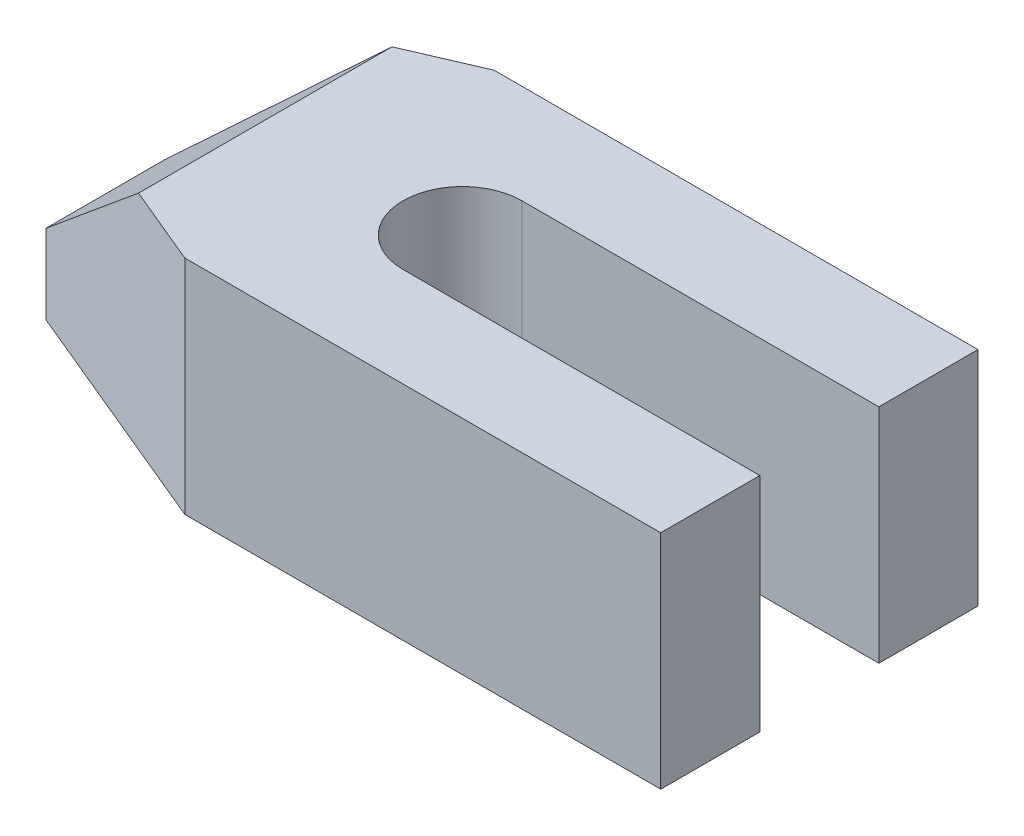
ISO-10303-21;
HEADER;
FILE_DESCRIPTION(('STEP AP214'),'2;1');
FILE_NAME('part.step','',(''),(''),'','','');
FILE_SCHEMA(('AUTOMOTIVE_DESIGN { 1 0 10303 214 1 1 1 1 }'));
ENDSEC;
DATA;
#1=APPLICATION_CONTEXT('core data for automotive mechanical design processes');
#2=APPLICATION_PROTOCOL_DEFINITION('international standard','automotive_design',2000,#1);
#3=PRODUCT_CONTEXT('',#1,'mechanical');
#4=PRODUCT('Part','Part','',(#3));
#5=PRODUCT_RELATED_PRODUCT_CATEGORY('part','',(#4));
#6=PRODUCT_DEFINITION_FORMATION('','',#4);
#7=PRODUCT_DEFINITION_CONTEXT('part definition',#1,'design');
#8=PRODUCT_DEFINITION('design','',#6,#7);
#9=PRODUCT_DEFINITION_SHAPE('','',#8);
#10=(LENGTH_UNIT() NAMED_UNIT(*) SI_UNIT(.MILLI.,.METRE.));
#11=(NAMED_UNIT(*) PLANE_ANGLE_UNIT() SI_UNIT($,.RADIAN.));
#12=(NAMED_UNIT(*) SI_UNIT($,.STERADIAN.) SOLID_ANGLE_UNIT());
#13=UNCERTAINTY_MEASURE_WITH_UNIT(LENGTH_MEASURE(1.E-05),#10,'distance_accuracy_value','');
#14=(GEOMETRIC_REPRESENTATION_CONTEXT(3) GLOBAL_UNCERTAINTY_ASSIGNED_CONTEXT((#13)) GLOBAL_UNIT_ASSIGNED_CONTEXT((#10,
#11,#12)) REPRESENTATION_CONTEXT('',''));
#15=CARTESIAN_POINT('',(0.,0.,0.));
#16=DIRECTION('',(0.,0.,1.));
#17=DIRECTION('',(1.,0.,0.));
#18=AXIS2_PLACEMENT_3D('',#15,#16,#17);
#19=CARTESIAN_POINT('',(-16.,28.,-20.));
#20=DIRECTION('',(0.395829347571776,0.,0.918324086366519));
#21=DIRECTION('',(0.918324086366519,0.,-0.395829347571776));
#22=AXIS2_PLACEMENT_3D('',#19,#20,#21);
#23=PLANE('',#22);
#24=DIRECTION('',(-0.707852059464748,-0.637066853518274,0.305108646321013));
#25=VECTOR('',#24,1.);
#26=CARTESIAN_POINT('',(-19.6526875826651,32.8125811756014,-18.4255656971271));
#27=LINE('',#26,#25);
#28=CARTESIAN_POINT('',(-25.,28.,-16.1206896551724));
#29=VERTEX_POINT('',#28);
#30=CARTESIAN_POINT('',(-45.,10.,-7.49999999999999));
#31=VERTEX_POINT('',#30);
#32=EDGE_CURVE('E149',#29,#31,#27,.T.);
#33=ORIENTED_EDGE('',*,*,#32,.F.);
#34=DIRECTION('',(-0.918324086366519,0.,0.395829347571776));
#35=VECTOR('',#34,1.);
#36=CARTESIAN_POINT('',(-16.,28.,-20.));
#37=LINE('',#36,#35);
#38=CARTESIAN_POINT('',(-16.,28.,-20.));
#39=VERTEX_POINT('',#38);
#40=EDGE_CURVE('E166',#39,#29,#37,.T.);
#41=ORIENTED_EDGE('',*,*,#40,.F.);
#42=DIRECTION('',(0.,-1.,0.));
#43=VECTOR('',#42,1.);
#44=CARTESIAN_POINT('',(-16.,28.,-20.));
#45=LINE('',#44,#43);
#46=CARTESIAN_POINT('',(-16.,0.,-20.));
#47=VERTEX_POINT('',#46);
#48=EDGE_CURVE('E141',#39,#47,#45,.T.);
#49=ORIENTED_EDGE('',*,*,#48,.T.);
#50=DIRECTION('',(-0.918324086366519,0.,0.395829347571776));
#51=VECTOR('',#50,1.);
#52=CARTESIAN_POINT('',(-16.,0.,-20.));
#53=LINE('',#52,#51);
#54=CARTESIAN_POINT('',(-45.,0.,-7.49999999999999));
#55=VERTEX_POINT('',#54);
#56=EDGE_CURVE('E145',#47,#55,#53,.T.);
#57=ORIENTED_EDGE('',*,*,#56,.T.);
#58=DIRECTION('',(0.,-1.,0.));
#59=VECTOR('',#58,1.);
#60=CARTESIAN_POINT('',(-45.,28.,-7.49999999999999));
#61=LINE('',#60,#59);
#62=EDGE_CURVE('E40',#31,#55,#61,.T.);
#63=ORIENTED_EDGE('',*,*,#62,.F.);
#64=EDGE_LOOP('',(#33,#41,#49,#57,#63));
#65=FACE_BOUND('',#64,.T.);
#66=ADVANCED_FACE('F33',(#65),#23,.F.);
#67=CARTESIAN_POINT('',(-45.,28.,-7.49999999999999));
#68=DIRECTION('',(1.,0.,0.));
#69=DIRECTION('',(0.,0.,-1.));
#70=AXIS2_PLACEMENT_3D('',#67,#68,#69);
#71=PLANE('',#70);
#72=DIRECTION('',(0.,0.,1.));
#73=VECTOR('',#72,1.);
#74=CARTESIAN_POINT('',(-45.,10.,-20.));
#75=LINE('',#74,#73);
#76=CARTESIAN_POINT('',(-45.,10.,7.50000000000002));
#77=VERTEX_POINT('',#76);
#78=EDGE_CURVE('E191',#31,#77,#75,.T.);
#79=ORIENTED_EDGE('',*,*,#78,.F.);
#80=ORIENTED_EDGE('',*,*,#62,.T.);
#81=DIRECTION('',(0.,0.,1.));
#82=VECTOR('',#81,1.);
#83=CARTESIAN_POINT('',(-45.,0.,-7.49999999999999));
#84=LINE('',#83,#82);
#85=CARTESIAN_POINT('',(-45.,0.,7.50000000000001));
#86=VERTEX_POINT('',#85);
#87=EDGE_CURVE('E148',#55,#86,#84,.T.);
#88=ORIENTED_EDGE('',*,*,#87,.T.);
#89=DIRECTION('',(0.,-1.,0.));
#90=VECTOR('',#89,1.);
#91=CARTESIAN_POINT('',(-45.,28.,7.50000000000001));
#92=LINE('',#91,#90);
#93=EDGE_CURVE('E182',#77,#86,#92,.T.);
#94=ORIENTED_EDGE('',*,*,#93,.F.);
#95=EDGE_LOOP('',(#79,#80,#88,#94));
#96=FACE_BOUND('',#95,.T.);
#97=ADVANCED_FACE('F187',(#96),#71,.F.);
#98=CARTESIAN_POINT('',(-15.,28.,20.));
#99=DIRECTION('',(0.384615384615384,0.,-0.923076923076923));
#100=DIRECTION('',(-0.923076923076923,0.,-0.384615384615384));
#101=AXIS2_PLACEMENT_3D('',#98,#99,#100);
#102=PLANE('',#101);
#103=DIRECTION('',(0.710021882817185,0.639019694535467,0.295842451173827));
#104=VECTOR('',#103,1.);
#105=CARTESIAN_POINT('',(-19.083461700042,33.3248844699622,18.2985576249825));
#106=LINE('',#105,#104);
#107=CARTESIAN_POINT('',(-25.,28.,15.8333333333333));
#108=VERTEX_POINT('',#107);
#109=EDGE_CURVE('E47',#77,#108,#106,.T.);
#110=ORIENTED_EDGE('',*,*,#109,.F.);
#111=ORIENTED_EDGE('',*,*,#93,.T.);
#112=DIRECTION('',(0.923076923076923,0.,0.384615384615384));
#113=VECTOR('',#112,1.);
#114=CARTESIAN_POINT('',(-15.,0.,20.));
#115=LINE('',#114,#113);
#116=CARTESIAN_POINT('',(-15.,0.,20.));
#117=VERTEX_POINT('',#116);
#118=EDGE_CURVE('E152',#86,#117,#115,.T.);
#119=ORIENTED_EDGE('',*,*,#118,.T.);
#120=DIRECTION('',(0.,-1.,0.));
#121=VECTOR('',#120,1.);
#122=CARTESIAN_POINT('',(-15.,28.,20.));
#123=LINE('',#122,#121);
#124=CARTESIAN_POINT('',(-15.,28.,20.));
#125=VERTEX_POINT('',#124);
#126=EDGE_CURVE('E179',#125,#117,#123,.T.);
#127=ORIENTED_EDGE('',*,*,#126,.F.);
#128=DIRECTION('',(0.923076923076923,0.,0.384615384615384));
#129=VECTOR('',#128,1.);
#130=CARTESIAN_POINT('',(-15.,28.,20.));
#131=LINE('',#130,#129);
#132=EDGE_CURVE('E101',#108,#125,#131,.T.);
#133=ORIENTED_EDGE('',*,*,#132,.F.);
#134=EDGE_LOOP('',(#110,#111,#119,#127,#133));
#135=FACE_BOUND('',#134,.T.);
#136=ADVANCED_FACE('F221',(#135),#102,.F.);
#137=CARTESIAN_POINT('',(0.,28.,0.));
#138=DIRECTION('',(0.,1.,0.));
#139=DIRECTION('',(0.,0.,1.));
#140=AXIS2_PLACEMENT_3D('',#137,#138,#139);
#141=PLANE('',#140);
#142=ORIENTED_EDGE('',*,*,#40,.T.);
#143=DIRECTION('',(0.,0.,1.));
#144=VECTOR('',#143,1.);
#145=CARTESIAN_POINT('',(-25.,28.,0.));
#146=LINE('',#145,#144);
#147=EDGE_CURVE('E11',#29,#108,#146,.T.);
#148=ORIENTED_EDGE('',*,*,#147,.T.);
#149=ORIENTED_EDGE('',*,*,#132,.T.);
#150=DIRECTION('',(1.,0.,0.));
#151=VECTOR('',#150,1.);
#152=CARTESIAN_POINT('',(-15.,28.,20.));
#153=LINE('',#152,#151);
#154=CARTESIAN_POINT('',(45.,28.,20.));
#155=VERTEX_POINT('',#154);
#156=EDGE_CURVE('E219',#125,#155,#153,.T.);
#157=ORIENTED_EDGE('',*,*,#156,.T.);
#158=DIRECTION('',(0.,0.,-1.));
#159=VECTOR('',#158,1.);
#160=CARTESIAN_POINT('',(45.,28.,7.5));
#161=LINE('',#160,#159);
#162=CARTESIAN_POINT('',(45.,28.,7.5));
#163=VERTEX_POINT('',#162);
#164=EDGE_CURVE('E214',#155,#163,#161,.T.);
#165=ORIENTED_EDGE('',*,*,#164,.T.);
#166=DIRECTION('',(-1.,0.,0.));
#167=VECTOR('',#166,1.);
#168=CARTESIAN_POINT('',(0.,28.,7.5));
#169=LINE('',#168,#167);
#170=CARTESIAN_POINT('',(0.,28.,7.5));
#171=VERTEX_POINT('',#170);
#172=EDGE_CURVE('E209',#163,#171,#169,.T.);
#173=ORIENTED_EDGE('',*,*,#172,.T.);
#174=CARTESIAN_POINT('',(0.,28.,0.));
#175=DIRECTION('',(0.,-1.,0.));
#176=DIRECTION('',(0.,0.,1.));
#177=AXIS2_PLACEMENT_3D('',#174,#175,#176);
#178=CIRCLE('',#177,7.5);
#179=CARTESIAN_POINT('',(0.,28.,-7.5));
#180=VERTEX_POINT('',#179);
#181=EDGE_CURVE('E124',#171,#180,#178,.T.);
#182=ORIENTED_EDGE('',*,*,#181,.T.);
#183=DIRECTION('',(1.,0.,0.));
#184=VECTOR('',#183,1.);
#185=CARTESIAN_POINT('',(0.,28.,-7.5));
#186=LINE('',#185,#184);
#187=CARTESIAN_POINT('',(45.,28.,-7.5));
#188=VERTEX_POINT('',#187);
#189=EDGE_CURVE('E117',#180,#188,#186,.T.);
#190=ORIENTED_EDGE('',*,*,#189,.T.);
#191=DIRECTION('',(0.,0.,-1.));
#192=VECTOR('',#191,1.);
#193=CARTESIAN_POINT('',(45.,28.,-20.));
#194=LINE('',#193,#192);
#195=CARTESIAN_POINT('',(45.,28.,-20.));
#196=VERTEX_POINT('',#195);
#197=EDGE_CURVE('E121',#188,#196,#194,.T.);
#198=ORIENTED_EDGE('',*,*,#197,.T.);
#199=DIRECTION('',(-1.,0.,0.));
#200=VECTOR('',#199,1.);
#201=CARTESIAN_POINT('',(-16.,28.,-20.));
#202=LINE('',#201,#200);
#203=EDGE_CURVE('E55',#196,#39,#202,.T.);
#204=ORIENTED_EDGE('',*,*,#203,.T.);
#205=EDGE_LOOP('',(#142,#148,#149,#157,#165,#173,#182,#190,#198,#204));
#206=FACE_BOUND('',#205,.T.);
#207=ADVANCED_FACE('F119',(#206),#141,.T.);
#208=CARTESIAN_POINT('',(-15.,28.,20.));
#209=DIRECTION('',(0.,0.,-1.));
#210=DIRECTION('',(-1.,0.,0.));
#211=AXIS2_PLACEMENT_3D('',#208,#209,#210);
#212=PLANE('',#211);
#213=DIRECTION('',(1.,0.,0.));
#214=VECTOR('',#213,1.);
#215=CARTESIAN_POINT('',(-15.,0.,20.));
#216=LINE('',#215,#214);
#217=CARTESIAN_POINT('',(45.,0.,20.));
#218=VERTEX_POINT('',#217);
#219=EDGE_CURVE('E154',#117,#218,#216,.T.);
#220=ORIENTED_EDGE('',*,*,#219,.T.);
#221=DIRECTION('',(0.,-1.,0.));
#222=VECTOR('',#221,1.);
#223=CARTESIAN_POINT('',(45.,28.,20.));
#224=LINE('',#223,#222);
#225=EDGE_CURVE('E176',#155,#218,#224,.T.);
#226=ORIENTED_EDGE('',*,*,#225,.F.);
#227=ORIENTED_EDGE('',*,*,#156,.F.);
#228=ORIENTED_EDGE('',*,*,#126,.T.);
#229=EDGE_LOOP('',(#220,#226,#227,#228));
#230=FACE_BOUND('',#229,.T.);
#231=ADVANCED_FACE('F217',(#230),#212,.F.);
#232=CARTESIAN_POINT('',(45.,28.,7.5));
#233=DIRECTION('',(-1.,0.,0.));
#234=DIRECTION('',(0.,0.,1.));
#235=AXIS2_PLACEMENT_3D('',#232,#233,#234);
#236=PLANE('',#235);
#237=DIRECTION('',(0.,0.,-1.));
#238=VECTOR('',#237,1.);
#239=CARTESIAN_POINT('',(45.,0.,7.5));
#240=LINE('',#239,#238);
#241=CARTESIAN_POINT('',(45.,0.,7.5));
#242=VERTEX_POINT('',#241);
#243=EDGE_CURVE('E156',#218,#242,#240,.T.);
#244=ORIENTED_EDGE('',*,*,#243,.T.);
#245=DIRECTION('',(0.,-1.,0.));
#246=VECTOR('',#245,1.);
#247=CARTESIAN_POINT('',(45.,28.,7.5));
#248=LINE('',#247,#246);
#249=EDGE_CURVE('E173',#163,#242,#248,.T.);
#250=ORIENTED_EDGE('',*,*,#249,.F.);
#251=ORIENTED_EDGE('',*,*,#164,.F.);
#252=ORIENTED_EDGE('',*,*,#225,.T.);
#253=EDGE_LOOP('',(#244,#250,#251,#252));
#254=FACE_BOUND('',#253,.T.);
#255=ADVANCED_FACE('F213',(#254),#236,.F.);
#256=CARTESIAN_POINT('',(0.,28.,7.5));
#257=DIRECTION('',(0.,0.,1.));
#258=DIRECTION('',(1.,0.,0.));
#259=AXIS2_PLACEMENT_3D('',#256,#257,#258);
#260=PLANE('',#259);
#261=DIRECTION('',(-1.,0.,0.));
#262=VECTOR('',#261,1.);
#263=CARTESIAN_POINT('',(0.,0.,7.5));
#264=LINE('',#263,#262);
#265=CARTESIAN_POINT('',(0.,0.,7.5));
#266=VERTEX_POINT('',#265);
#267=EDGE_CURVE('E158',#242,#266,#264,.T.);
#268=ORIENTED_EDGE('',*,*,#267,.T.);
#269=DIRECTION('',(0.,-1.,0.));
#270=VECTOR('',#269,1.);
#271=CARTESIAN_POINT('',(0.,28.,7.5));
#272=LINE('',#271,#270);
#273=EDGE_CURVE('E170',#171,#266,#272,.T.);
#274=ORIENTED_EDGE('',*,*,#273,.F.);
#275=ORIENTED_EDGE('',*,*,#172,.F.);
#276=ORIENTED_EDGE('',*,*,#249,.T.);
#277=EDGE_LOOP('',(#268,#274,#275,#276));
#278=FACE_BOUND('',#277,.T.);
#279=ADVANCED_FACE('F208',(#278),#260,.F.);
#280=CARTESIAN_POINT('',(0.,28.,0.));
#281=DIRECTION('',(0.,-1.,0.));
#282=DIRECTION('',(0.,0.,-1.));
#283=AXIS2_PLACEMENT_3D('',#280,#281,#282);
#284=CYLINDRICAL_SURFACE('',#283,7.5);
#285=CARTESIAN_POINT('',(0.,0.,0.));
#286=DIRECTION('',(0.,-1.,0.));
#287=DIRECTION('',(0.,0.,1.));
#288=AXIS2_PLACEMENT_3D('',#285,#286,#287);
#289=CIRCLE('',#288,7.5);
#290=CARTESIAN_POINT('',(0.,0.,-7.5));
#291=VERTEX_POINT('',#290);
#292=EDGE_CURVE('E160',#266,#291,#289,.T.);
#293=ORIENTED_EDGE('',*,*,#292,.T.);
#294=DIRECTION('',(0.,-1.,0.));
#295=VECTOR('',#294,1.);
#296=CARTESIAN_POINT('',(0.,28.,-7.5));
#297=LINE('',#296,#295);
#298=EDGE_CURVE('E136',#180,#291,#297,.T.);
#299=ORIENTED_EDGE('',*,*,#298,.F.);
#300=ORIENTED_EDGE('',*,*,#181,.F.);
#301=ORIENTED_EDGE('',*,*,#273,.T.);
#302=EDGE_LOOP('',(#293,#299,#300,#301));
#303=FACE_BOUND('',#302,.T.);
#304=ADVANCED_FACE('F204',(#303),#284,.F.);
#305=CARTESIAN_POINT('',(0.,28.,-7.5));
#306=DIRECTION('',(0.,0.,-1.));
#307=DIRECTION('',(-1.,0.,0.));
#308=AXIS2_PLACEMENT_3D('',#305,#306,#307);
#309=PLANE('',#308);
#310=DIRECTION('',(1.,0.,0.));
#311=VECTOR('',#310,1.);
#312=CARTESIAN_POINT('',(0.,0.,-7.5));
#313=LINE('',#312,#311);
#314=CARTESIAN_POINT('',(45.,0.,-7.5));
#315=VERTEX_POINT('',#314);
#316=EDGE_CURVE('E133',#291,#315,#313,.T.);
#317=ORIENTED_EDGE('',*,*,#316,.T.);
#318=DIRECTION('',(0.,-1.,0.));
#319=VECTOR('',#318,1.);
#320=CARTESIAN_POINT('',(45.,28.,-7.5));
#321=LINE('',#320,#319);
#322=EDGE_CURVE('E130',#188,#315,#321,.T.);
#323=ORIENTED_EDGE('',*,*,#322,.F.);
#324=ORIENTED_EDGE('',*,*,#189,.F.);
#325=ORIENTED_EDGE('',*,*,#298,.T.);
#326=EDGE_LOOP('',(#317,#323,#324,#325));
#327=FACE_BOUND('',#326,.T.);
#328=ADVANCED_FACE('F131',(#327),#309,.F.);
#329=CARTESIAN_POINT('',(45.,28.,-20.));
#330=DIRECTION('',(-1.,0.,0.));
#331=DIRECTION('',(0.,0.,1.));
#332=AXIS2_PLACEMENT_3D('',#329,#330,#331);
#333=PLANE('',#332);
#334=DIRECTION('',(0.,0.,-1.));
#335=VECTOR('',#334,1.);
#336=CARTESIAN_POINT('',(45.,0.,-20.));
#337=LINE('',#336,#335);
#338=CARTESIAN_POINT('',(45.,0.,-20.));
#339=VERTEX_POINT('',#338);
#340=EDGE_CURVE('E163',#315,#339,#337,.T.);
#341=ORIENTED_EDGE('',*,*,#340,.T.);
#342=DIRECTION('',(0.,-1.,0.));
#343=VECTOR('',#342,1.);
#344=CARTESIAN_POINT('',(45.,28.,-20.));
#345=LINE('',#344,#343);
#346=EDGE_CURVE('E137',#196,#339,#345,.T.);
#347=ORIENTED_EDGE('',*,*,#346,.F.);
#348=ORIENTED_EDGE('',*,*,#197,.F.);
#349=ORIENTED_EDGE('',*,*,#322,.T.);
#350=EDGE_LOOP('',(#341,#347,#348,#349));
#351=FACE_BOUND('',#350,.T.);
#352=ADVANCED_FACE('F139',(#351),#333,.F.);
#353=CARTESIAN_POINT('',(-16.,28.,-20.));
#354=DIRECTION('',(0.,0.,1.));
#355=DIRECTION('',(1.,0.,0.));
#356=AXIS2_PLACEMENT_3D('',#353,#354,#355);
#357=PLANE('',#356);
#358=DIRECTION('',(-1.,0.,0.));
#359=VECTOR('',#358,1.);
#360=CARTESIAN_POINT('',(-16.,0.,-20.));
#361=LINE('',#360,#359);
#362=EDGE_CURVE('E94',#339,#47,#361,.T.);
#363=ORIENTED_EDGE('',*,*,#362,.T.);
#364=ORIENTED_EDGE('',*,*,#48,.F.);
#365=ORIENTED_EDGE('',*,*,#203,.F.);
#366=ORIENTED_EDGE('',*,*,#346,.T.);
#367=EDGE_LOOP('',(#363,#364,#365,#366));
#368=FACE_BOUND('',#367,.T.);
#369=ADVANCED_FACE('F199',(#368),#357,.F.);
#370=CARTESIAN_POINT('',(0.,0.,0.));
#371=DIRECTION('',(0.,1.,0.));
#372=DIRECTION('',(0.,0.,1.));
#373=AXIS2_PLACEMENT_3D('',#370,#371,#372);
#374=PLANE('',#373);
#375=ORIENTED_EDGE('',*,*,#56,.F.);
#376=ORIENTED_EDGE('',*,*,#362,.F.);
#377=ORIENTED_EDGE('',*,*,#340,.F.);
#378=ORIENTED_EDGE('',*,*,#316,.F.);
#379=ORIENTED_EDGE('',*,*,#292,.F.);
#380=ORIENTED_EDGE('',*,*,#267,.F.);
#381=ORIENTED_EDGE('',*,*,#243,.F.);
#382=ORIENTED_EDGE('',*,*,#219,.F.);
#383=ORIENTED_EDGE('',*,*,#118,.F.);
#384=ORIENTED_EDGE('',*,*,#87,.F.);
#385=EDGE_LOOP('',(#375,#376,#377,#378,#379,#380,#381,#382,#383,#384));
#386=FACE_BOUND('',#385,.T.);
#387=ADVANCED_FACE('F196',(#386),#374,.F.);
#388=CARTESIAN_POINT('',(-45.,10.,-20.));
#389=DIRECTION('',(-0.66896473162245,0.743294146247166,0.));
#390=DIRECTION('',(-0.743294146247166,-0.66896473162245,0.));
#391=AXIS2_PLACEMENT_3D('',#388,#389,#390);
#392=PLANE('',#391);
#393=ORIENTED_EDGE('',*,*,#32,.T.);
#394=ORIENTED_EDGE('',*,*,#78,.T.);
#395=ORIENTED_EDGE('',*,*,#109,.T.);
#396=ORIENTED_EDGE('',*,*,#147,.F.);
#397=EDGE_LOOP('',(#393,#394,#395,#396));
#398=FACE_BOUND('',#397,.T.);
#399=ADVANCED_FACE('F225',(#398),#392,.T.);
#400=CLOSED_SHELL('',(#66,#97,#136,#207,#231,#255,#279,#304,#328,#352,#369,#387,#399));
#401=MANIFOLD_SOLID_BREP('B2',#400);
#402=ADVANCED_BREP_SHAPE_REPRESENTATION('',(#18,#401),#14);
#403=SHAPE_DEFINITION_REPRESENTATION(#9,#402);
ENDSEC;
END-ISO-10303-21;
